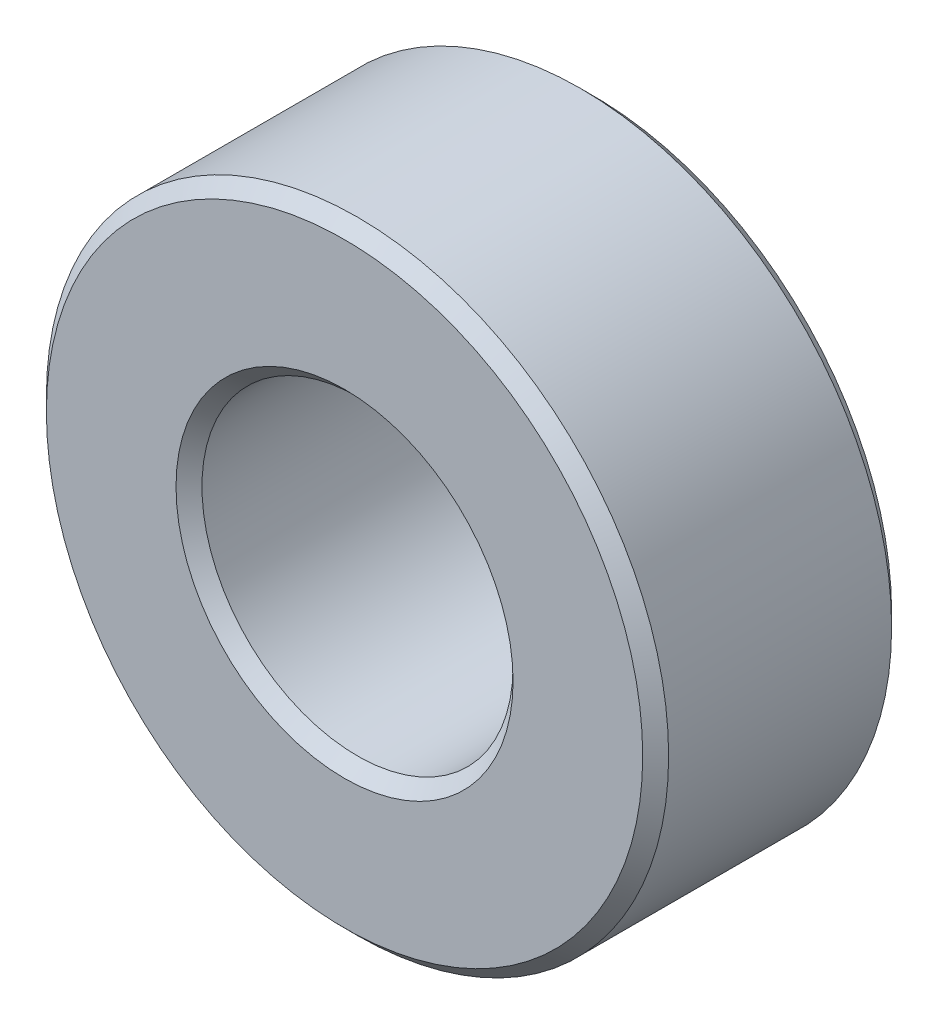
ISO-10303-21;
HEADER;
FILE_DESCRIPTION(('STEP AP214'),'2;1');
FILE_NAME('part.step','',(''),(''),'','','');
FILE_SCHEMA(('AUTOMOTIVE_DESIGN { 1 0 10303 214 1 1 1 1 }'));
ENDSEC;
DATA;
#1=APPLICATION_CONTEXT('core data for automotive mechanical design processes');
#2=APPLICATION_PROTOCOL_DEFINITION('international standard','automotive_design',2000,#1);
#3=PRODUCT_CONTEXT('',#1,'mechanical');
#4=PRODUCT('Part','Part','',(#3));
#5=PRODUCT_RELATED_PRODUCT_CATEGORY('part','',(#4));
#6=PRODUCT_DEFINITION_FORMATION('','',#4);
#7=PRODUCT_DEFINITION_CONTEXT('part definition',#1,'design');
#8=PRODUCT_DEFINITION('design','',#6,#7);
#9=PRODUCT_DEFINITION_SHAPE('','',#8);
#10=(LENGTH_UNIT() NAMED_UNIT(*) SI_UNIT(.MILLI.,.METRE.));
#11=(NAMED_UNIT(*) PLANE_ANGLE_UNIT() SI_UNIT($,.RADIAN.));
#12=(NAMED_UNIT(*) SI_UNIT($,.STERADIAN.) SOLID_ANGLE_UNIT());
#13=UNCERTAINTY_MEASURE_WITH_UNIT(LENGTH_MEASURE(1.E-05),#10,'distance_accuracy_value','');
#14=(GEOMETRIC_REPRESENTATION_CONTEXT(3) GLOBAL_UNCERTAINTY_ASSIGNED_CONTEXT((#13)) GLOBAL_UNIT_ASSIGNED_CONTEXT((#10,
#11,#12)) REPRESENTATION_CONTEXT('',''));
#15=CARTESIAN_POINT('',(0.,0.,0.));
#16=DIRECTION('',(0.,0.,1.));
#17=DIRECTION('',(1.,0.,0.));
#18=AXIS2_PLACEMENT_3D('',#15,#16,#17);
#19=CARTESIAN_POINT('',(0.,0.,4.8));
#20=DIRECTION('',(0.,0.,1.));
#21=DIRECTION('',(1.,0.,0.));
#22=AXIS2_PLACEMENT_3D('',#19,#20,#21);
#23=PLANE('',#22);
#24=CARTESIAN_POINT('',(0.,0.,4.8));
#25=DIRECTION('',(0.,0.,1.));
#26=DIRECTION('',(1.,0.,0.));
#27=AXIS2_PLACEMENT_3D('',#24,#25,#26);
#28=CIRCLE('',#27,6.5);
#29=CARTESIAN_POINT('',(6.5,0.,4.8));
#30=VERTEX_POINT('',#29);
#31=EDGE_CURVE('E47',#30,#30,#28,.F.);
#32=ORIENTED_EDGE('',*,*,#31,.T.);
#33=EDGE_LOOP('',(#32));
#34=FACE_BOUND('',#33,.T.);
#35=CARTESIAN_POINT('',(0.,0.,4.8));
#36=DIRECTION('',(0.,0.,1.));
#37=DIRECTION('',(1.,0.,0.));
#38=AXIS2_PLACEMENT_3D('',#35,#36,#37);
#39=CIRCLE('',#38,11.5);
#40=CARTESIAN_POINT('',(11.5,0.,4.8));
#41=VERTEX_POINT('',#40);
#42=EDGE_CURVE('E51',#41,#41,#39,.T.);
#43=ORIENTED_EDGE('',*,*,#42,.T.);
#44=EDGE_LOOP('',(#43));
#45=FACE_BOUND('',#44,.T.);
#46=ADVANCED_FACE('F36',(#34,#45),#23,.T.);
#47=CARTESIAN_POINT('',(0.,0.,-4.8));
#48=DIRECTION('',(0.,0.,1.));
#49=DIRECTION('',(1.,0.,0.));
#50=AXIS2_PLACEMENT_3D('',#47,#48,#49);
#51=PLANE('',#50);
#52=CARTESIAN_POINT('',(0.,0.,-4.8));
#53=DIRECTION('',(0.,0.,1.));
#54=DIRECTION('',(1.,0.,0.));
#55=AXIS2_PLACEMENT_3D('',#52,#53,#54);
#56=CIRCLE('',#55,6.5);
#57=CARTESIAN_POINT('',(6.5,0.,-4.8));
#58=VERTEX_POINT('',#57);
#59=EDGE_CURVE('E62',#58,#58,#56,.T.);
#60=ORIENTED_EDGE('',*,*,#59,.T.);
#61=EDGE_LOOP('',(#60));
#62=FACE_BOUND('',#61,.T.);
#63=CARTESIAN_POINT('',(0.,0.,-4.8));
#64=DIRECTION('',(0.,0.,1.));
#65=DIRECTION('',(1.,0.,0.));
#66=AXIS2_PLACEMENT_3D('',#63,#64,#65);
#67=CIRCLE('',#66,11.5);
#68=CARTESIAN_POINT('',(11.5,0.,-4.8));
#69=VERTEX_POINT('',#68);
#70=EDGE_CURVE('E65',#69,#69,#67,.F.);
#71=ORIENTED_EDGE('',*,*,#70,.T.);
#72=EDGE_LOOP('',(#71));
#73=FACE_BOUND('',#72,.T.);
#74=ADVANCED_FACE('F69',(#62,#73),#51,.F.);
#75=CARTESIAN_POINT('',(0.,0.,4.8));
#76=DIRECTION('',(0.,0.,-1.));
#77=DIRECTION('',(-1.,0.,0.));
#78=AXIS2_PLACEMENT_3D('',#75,#76,#77);
#79=CYLINDRICAL_SURFACE('',#78,12.);
#80=CARTESIAN_POINT('',(0.,0.,-4.3));
#81=DIRECTION('',(0.,0.,1.));
#82=DIRECTION('',(1.,0.,0.));
#83=AXIS2_PLACEMENT_3D('',#80,#81,#82);
#84=CIRCLE('',#83,12.);
#85=CARTESIAN_POINT('',(12.,0.,-4.3));
#86=VERTEX_POINT('',#85);
#87=EDGE_CURVE('E10',#86,#86,#84,.T.);
#88=ORIENTED_EDGE('',*,*,#87,.T.);
#89=EDGE_LOOP('',(#88));
#90=FACE_BOUND('',#89,.T.);
#91=CARTESIAN_POINT('',(0.,0.,4.30000000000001));
#92=DIRECTION('',(0.,0.,1.));
#93=DIRECTION('',(1.,0.,0.));
#94=AXIS2_PLACEMENT_3D('',#91,#92,#93);
#95=CIRCLE('',#94,12.);
#96=CARTESIAN_POINT('',(12.,0.,4.30000000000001));
#97=VERTEX_POINT('',#96);
#98=EDGE_CURVE('E43',#97,#97,#95,.F.);
#99=ORIENTED_EDGE('',*,*,#98,.T.);
#100=EDGE_LOOP('',(#99));
#101=FACE_BOUND('',#100,.T.);
#102=ADVANCED_FACE('F89',(#90,#101),#79,.T.);
#103=CARTESIAN_POINT('',(0.,0.,4.8));
#104=DIRECTION('',(0.,0.,-1.));
#105=DIRECTION('',(-1.,0.,0.));
#106=AXIS2_PLACEMENT_3D('',#103,#104,#105);
#107=CYLINDRICAL_SURFACE('',#106,6.);
#108=CARTESIAN_POINT('',(0.,0.,-4.3));
#109=DIRECTION('',(0.,0.,1.));
#110=DIRECTION('',(1.,0.,0.));
#111=AXIS2_PLACEMENT_3D('',#108,#109,#110);
#112=CIRCLE('',#111,6.);
#113=CARTESIAN_POINT('',(6.,0.,-4.3));
#114=VERTEX_POINT('',#113);
#115=EDGE_CURVE('E56',#114,#114,#112,.F.);
#116=ORIENTED_EDGE('',*,*,#115,.T.);
#117=EDGE_LOOP('',(#116));
#118=FACE_BOUND('',#117,.T.);
#119=CARTESIAN_POINT('',(0.,0.,4.3));
#120=DIRECTION('',(0.,0.,1.));
#121=DIRECTION('',(1.,0.,0.));
#122=AXIS2_PLACEMENT_3D('',#119,#120,#121);
#123=CIRCLE('',#122,6.);
#124=CARTESIAN_POINT('',(6.,0.,4.3));
#125=VERTEX_POINT('',#124);
#126=EDGE_CURVE('E59',#125,#125,#123,.T.);
#127=ORIENTED_EDGE('',*,*,#126,.T.);
#128=EDGE_LOOP('',(#127));
#129=FACE_BOUND('',#128,.T.);
#130=ADVANCED_FACE('F94',(#118,#129),#107,.F.);
#131=CARTESIAN_POINT('',(0.,0.,-4.8));
#132=DIRECTION('',(0.,0.,-1.));
#133=DIRECTION('',(-1.,0.,0.));
#134=AXIS2_PLACEMENT_3D('',#131,#132,#133);
#135=CONICAL_SURFACE('',#134,6.5,0.785398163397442);
#136=ORIENTED_EDGE('',*,*,#115,.F.);
#137=EDGE_LOOP('',(#136));
#138=FACE_BOUND('',#137,.T.);
#139=ORIENTED_EDGE('',*,*,#59,.F.);
#140=EDGE_LOOP('',(#139));
#141=FACE_BOUND('',#140,.T.);
#142=ADVANCED_FACE('F80',(#138,#141),#135,.F.);
#143=CARTESIAN_POINT('',(0.,0.,4.3));
#144=DIRECTION('',(0.,0.,1.));
#145=DIRECTION('',(1.,0.,0.));
#146=AXIS2_PLACEMENT_3D('',#143,#144,#145);
#147=CONICAL_SURFACE('',#146,6.,0.785398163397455);
#148=ORIENTED_EDGE('',*,*,#31,.F.);
#149=EDGE_LOOP('',(#148));
#150=FACE_BOUND('',#149,.T.);
#151=ORIENTED_EDGE('',*,*,#126,.F.);
#152=EDGE_LOOP('',(#151));
#153=FACE_BOUND('',#152,.T.);
#154=ADVANCED_FACE('F74',(#150,#153),#147,.F.);
#155=CARTESIAN_POINT('',(0.,0.,-4.3));
#156=DIRECTION('',(0.,0.,1.));
#157=DIRECTION('',(1.,0.,0.));
#158=AXIS2_PLACEMENT_3D('',#155,#156,#157);
#159=CONICAL_SURFACE('',#158,12.,0.785398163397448);
#160=ORIENTED_EDGE('',*,*,#70,.F.);
#161=EDGE_LOOP('',(#160));
#162=FACE_BOUND('',#161,.T.);
#163=ORIENTED_EDGE('',*,*,#87,.F.);
#164=EDGE_LOOP('',(#163));
#165=FACE_BOUND('',#164,.T.);
#166=ADVANCED_FACE('F71',(#162,#165),#159,.T.);
#167=CARTESIAN_POINT('',(0.,0.,4.8));
#168=DIRECTION('',(0.,0.,-1.));
#169=DIRECTION('',(-1.,0.,0.));
#170=AXIS2_PLACEMENT_3D('',#167,#168,#169);
#171=CONICAL_SURFACE('',#170,11.5,0.785398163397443);
#172=ORIENTED_EDGE('',*,*,#98,.F.);
#173=EDGE_LOOP('',(#172));
#174=FACE_BOUND('',#173,.T.);
#175=ORIENTED_EDGE('',*,*,#42,.F.);
#176=EDGE_LOOP('',(#175));
#177=FACE_BOUND('',#176,.T.);
#178=ADVANCED_FACE('F38',(#174,#177),#171,.T.);
#179=CLOSED_SHELL('',(#46,#74,#102,#130,#142,#154,#166,#178));
#180=MANIFOLD_SOLID_BREP('B2',#179);
#181=ADVANCED_BREP_SHAPE_REPRESENTATION('',(#18,#180),#14);
#182=SHAPE_DEFINITION_REPRESENTATION(#9,#181);
ENDSEC;
END-ISO-10303-21;
